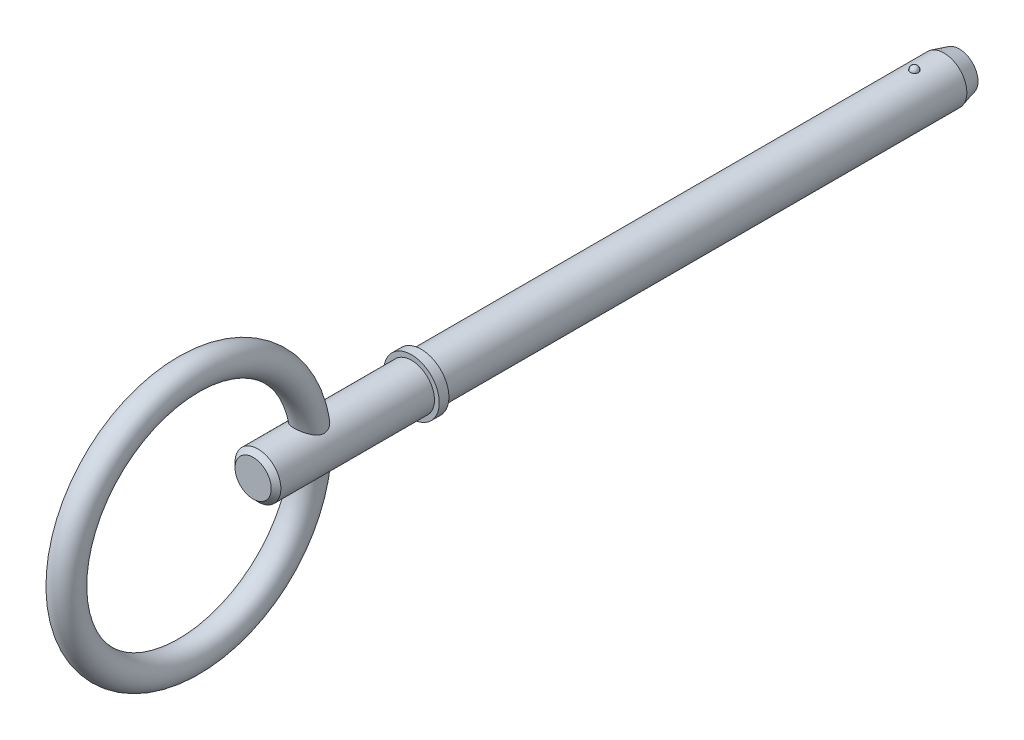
ISO-10303-21;
HEADER;
FILE_DESCRIPTION(('STEP AP214'),'2;1');
FILE_NAME('part.step','',(''),(''),'','','');
FILE_SCHEMA(('AUTOMOTIVE_DESIGN { 1 0 10303 214 1 1 1 1 }'));
ENDSEC;
DATA;
#1=APPLICATION_CONTEXT('core data for automotive mechanical design processes');
#2=APPLICATION_PROTOCOL_DEFINITION('international standard','automotive_design',2000,#1);
#3=PRODUCT_CONTEXT('',#1,'mechanical');
#4=PRODUCT('Part','Part','',(#3));
#5=PRODUCT_RELATED_PRODUCT_CATEGORY('part','',(#4));
#6=PRODUCT_DEFINITION_FORMATION('','',#4);
#7=PRODUCT_DEFINITION_CONTEXT('part definition',#1,'design');
#8=PRODUCT_DEFINITION('design','',#6,#7);
#9=PRODUCT_DEFINITION_SHAPE('','',#8);
#10=(LENGTH_UNIT() NAMED_UNIT(*) SI_UNIT(.MILLI.,.METRE.));
#11=(NAMED_UNIT(*) PLANE_ANGLE_UNIT() SI_UNIT($,.RADIAN.));
#12=(NAMED_UNIT(*) SI_UNIT($,.STERADIAN.) SOLID_ANGLE_UNIT());
#13=UNCERTAINTY_MEASURE_WITH_UNIT(LENGTH_MEASURE(1.E-05),#10,'distance_accuracy_value','');
#14=(GEOMETRIC_REPRESENTATION_CONTEXT(3) GLOBAL_UNCERTAINTY_ASSIGNED_CONTEXT((#13)) GLOBAL_UNIT_ASSIGNED_CONTEXT((#10,
#11,#12)) REPRESENTATION_CONTEXT('',''));
#15=CARTESIAN_POINT('',(0.,0.,0.));
#16=DIRECTION('',(0.,0.,1.));
#17=DIRECTION('',(1.,0.,0.));
#18=AXIS2_PLACEMENT_3D('',#15,#16,#17);
#19=CARTESIAN_POINT('',(0.,0.,50.8));
#20=DIRECTION('',(0.,0.,-1.));
#21=DIRECTION('',(-1.,0.,0.));
#22=AXIS2_PLACEMENT_3D('',#19,#20,#21);
#23=CYLINDRICAL_SURFACE('',#22,2.38);
#24=CARTESIAN_POINT('',(0.418361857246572,2.34294117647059,-0.419999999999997));
#25=CARTESIAN_POINT('',(0.418361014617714,2.34294160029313,-0.396453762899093));
#26=CARTESIAN_POINT('',(0.416399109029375,2.34329426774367,-0.372895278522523));
#27=CARTESIAN_POINT('',(0.408599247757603,2.34466666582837,-0.32643458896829));
#28=CARTESIAN_POINT('',(0.402757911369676,2.34568697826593,-0.303532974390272));
#29=CARTESIAN_POINT('',(0.387358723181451,2.3482789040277,-0.259059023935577));
#30=CARTESIAN_POINT('',(0.377802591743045,2.34985026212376,-0.237486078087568));
#31=CARTESIAN_POINT('',(0.355233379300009,2.35336760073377,-0.196270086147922));
#32=CARTESIAN_POINT('',(0.34222083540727,2.3553135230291,-0.176626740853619));
#33=CARTESIAN_POINT('',(0.313060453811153,2.35936636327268,-0.139777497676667));
#34=CARTESIAN_POINT('',(0.296906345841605,2.36147359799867,-0.122576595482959));
#35=CARTESIAN_POINT('',(0.261921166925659,2.3656092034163,-0.0911421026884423));
#36=CARTESIAN_POINT('',(0.243090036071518,2.36763757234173,-0.0769085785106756));
#37=CARTESIAN_POINT('',(0.203297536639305,2.37138533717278,-0.0518262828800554));
#38=CARTESIAN_POINT('',(0.182338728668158,2.37310509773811,-0.0409735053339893));
#39=CARTESIAN_POINT('',(0.138864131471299,2.37604521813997,-0.0229395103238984));
#40=CARTESIAN_POINT('',(0.116348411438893,2.37726560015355,-0.0157581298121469));
#41=CARTESIAN_POINT('',(0.0705754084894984,2.37906276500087,-0.00531205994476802));
#42=CARTESIAN_POINT('',(0.0473247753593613,2.37964420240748,-0.00201903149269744));
#43=CARTESIAN_POINT('',(0.000593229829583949,2.38011460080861,0.000651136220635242));
#44=CARTESIAN_POINT('',(-0.0228876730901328,2.38000359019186,2.84360175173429E-05));
#45=CARTESIAN_POINT('',(-0.0692686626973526,2.37910422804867,-0.00509943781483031));
#46=CARTESIAN_POINT('',(-0.0921713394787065,2.37831983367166,-0.00958192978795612));
#47=CARTESIAN_POINT('',(-0.136890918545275,2.37616546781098,-0.022272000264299));
#48=CARTESIAN_POINT('',(-0.158707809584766,2.37479549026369,-0.0304796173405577));
#49=CARTESIAN_POINT('',(-0.200704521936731,2.37161607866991,-0.0504168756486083));
#50=CARTESIAN_POINT('',(-0.220879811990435,2.36980547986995,-0.0621558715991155));
#51=CARTESIAN_POINT('',(-0.258974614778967,2.36594575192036,-0.0888218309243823));
#52=CARTESIAN_POINT('',(-0.276894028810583,2.36389661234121,-0.103748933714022));
#53=CARTESIAN_POINT('',(-0.310124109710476,2.35976825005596,-0.136509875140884));
#54=CARTESIAN_POINT('',(-0.325413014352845,2.35768891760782,-0.154365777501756));
#55=CARTESIAN_POINT('',(-0.352793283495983,2.35374782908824,-0.192402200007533));
#56=CARTESIAN_POINT('',(-0.364884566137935,2.35188607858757,-0.212582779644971));
#57=CARTESIAN_POINT('',(-0.385587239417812,2.34858114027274,-0.254794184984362));
#58=CARTESIAN_POINT('',(-0.394183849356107,2.34713973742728,-0.276832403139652));
#59=CARTESIAN_POINT('',(-0.407590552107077,2.3448489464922,-0.322061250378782));
#60=CARTESIAN_POINT('',(-0.412400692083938,2.34399955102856,-0.34525186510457));
#61=CARTESIAN_POINT('',(-0.418098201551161,2.34299005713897,-0.392078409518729));
#62=CARTESIAN_POINT('',(-0.41899328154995,2.34282860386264,-0.415713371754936));
#63=CARTESIAN_POINT('',(-0.416857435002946,2.34320955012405,-0.462799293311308));
#64=CARTESIAN_POINT('',(-0.413826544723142,2.34375194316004,-0.486250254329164));
#65=CARTESIAN_POINT('',(-0.403929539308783,2.34547773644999,-0.532261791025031));
#66=CARTESIAN_POINT('',(-0.397069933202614,2.34666004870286,-0.554823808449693));
#67=CARTESIAN_POINT('',(-0.379705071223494,2.34953208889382,-0.59846383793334));
#68=CARTESIAN_POINT('',(-0.369199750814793,2.35122182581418,-0.61954182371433));
#69=CARTESIAN_POINT('',(-0.344797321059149,2.35492396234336,-0.659671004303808));
#70=CARTESIAN_POINT('',(-0.33089223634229,2.35693711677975,-0.678717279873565));
#71=CARTESIAN_POINT('',(-0.300080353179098,2.36105754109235,-0.714192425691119));
#72=CARTESIAN_POINT('',(-0.283173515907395,2.36316481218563,-0.730621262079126));
#73=CARTESIAN_POINT('',(-0.246801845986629,2.36723962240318,-0.760416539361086));
#74=CARTESIAN_POINT('',(-0.227334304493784,2.36920701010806,-0.773779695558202));
#75=CARTESIAN_POINT('',(-0.186398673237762,2.37277833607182,-0.797042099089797));
#76=CARTESIAN_POINT('',(-0.164930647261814,2.37438228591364,-0.806941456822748));
#77=CARTESIAN_POINT('',(-0.120727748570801,2.37703848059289,-0.82294821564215));
#78=CARTESIAN_POINT('',(-0.0980005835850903,2.37809374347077,-0.829076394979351));
#79=CARTESIAN_POINT('',(-0.0518218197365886,2.37954782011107,-0.837451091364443));
#80=CARTESIAN_POINT('',(-0.0283702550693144,2.37994666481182,-0.839697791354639));
#81=CARTESIAN_POINT('',(0.0184023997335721,2.38004290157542,-0.840243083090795));
#82=CARTESIAN_POINT('',(0.0417231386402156,2.37974556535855,-0.838571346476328));
#83=CARTESIAN_POINT('',(0.0877471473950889,2.37849333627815,-0.831389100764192));
#84=CARTESIAN_POINT('',(0.110450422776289,2.37753844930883,-0.825878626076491));
#85=CARTESIAN_POINT('',(0.154584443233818,2.37507730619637,-0.811179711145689));
#86=CARTESIAN_POINT('',(0.17601599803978,2.37357140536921,-0.801993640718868));
#87=CARTESIAN_POINT('',(0.217028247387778,2.37017355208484,-0.780200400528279));
#88=CARTESIAN_POINT('',(0.236608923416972,2.36828159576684,-0.767593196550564));
#89=CARTESIAN_POINT('',(0.27351405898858,2.36430486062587,-0.739207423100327));
#90=CARTESIAN_POINT('',(0.290821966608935,2.36221883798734,-0.723407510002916));
#91=CARTESIAN_POINT('',(0.322554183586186,2.3580957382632,-0.68912612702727));
#92=CARTESIAN_POINT('',(0.336977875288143,2.35605867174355,-0.670644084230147));
#93=CARTESIAN_POINT('',(0.362636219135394,2.35224677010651,-0.63138169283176));
#94=CARTESIAN_POINT('',(0.373848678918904,2.35047379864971,-0.610586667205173));
#95=CARTESIAN_POINT('',(0.392641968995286,2.34740786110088,-0.567397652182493));
#96=CARTESIAN_POINT('',(0.400225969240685,2.34611447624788,-0.545005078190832));
#97=CARTESIAN_POINT('',(0.410033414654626,2.34441668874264,-0.505456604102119));
#98=CARTESIAN_POINT('',(0.413152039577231,2.34386644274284,-0.488523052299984));
#99=CARTESIAN_POINT('',(0.417316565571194,2.34312853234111,-0.454395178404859));
#100=CARTESIAN_POINT('',(0.418362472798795,2.34294086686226,-0.437200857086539));
#101=CARTESIAN_POINT('',(0.418361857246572,2.34294117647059,-0.419999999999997));
#102=B_SPLINE_CURVE_WITH_KNOTS('',3,(#24,#25,#26,#27,#28,#29,#30,#31,#32,#33,#34,#35,#36,#37,
#38,#39,#40,#41,#42,#43,#44,#45,#46,#47,#48,#49,#50,#51,#52,#53,#54,#55,#56,#57,#58,#59,#60,#61,
#62,#63,#64,#65,#66,#67,#68,#69,#70,#71,#72,#73,#74,#75,#76,#77,#78,#79,#80,#81,#82,#83,#84,#85,
#86,#87,#88,#89,#90,#91,#92,#93,#94,#95,#96,#97,#98,#99,#100,#101),.UNSPECIFIED.,.T.,.F.,(4,2,2,
2,2,2,2,2,2,2,2,2,2,2,2,2,2,2,2,2,2,2,2,2,2,2,2,2,2,2,2,2,2,2,2,2,2,2,4),(0.,0.0705763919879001,
0.141214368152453,0.211819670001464,0.282414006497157,0.353150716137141,0.423889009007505,
0.494543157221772,0.565194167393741,0.635327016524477,0.705456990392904,0.77517764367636,
0.844899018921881,0.914806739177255,0.98471751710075,1.05518143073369,1.1256471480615,
1.19640787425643,1.26716771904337,1.33778814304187,1.40840791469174,1.47890799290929,
1.54940931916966,1.62007764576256,1.69074688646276,1.76149149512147,1.83223384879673,
1.90258285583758,1.97292854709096,2.04274328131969,2.11255738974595,2.18232655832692,
2.25209642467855,2.32234913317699,2.39261687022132,2.4633591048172,2.5340394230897,
2.58559662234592,2.63715366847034),.UNSPECIFIED.);
#103=CARTESIAN_POINT('',(0.418361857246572,2.34294117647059,-0.419999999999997));
#104=VERTEX_POINT('',#103);
#105=EDGE_CURVE('E103',#104,#104,#102,.T.);
#106=ORIENTED_EDGE('',*,*,#105,.T.);
#107=EDGE_LOOP('',(#106));
#108=FACE_BOUND('',#107,.T.);
#109=CARTESIAN_POINT('',(0.,0.,-3.49399999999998));
#110=DIRECTION('',(0.,0.,-1.));
#111=DIRECTION('',(-1.,0.,0.));
#112=AXIS2_PLACEMENT_3D('',#109,#110,#111);
#113=CIRCLE('',#112,2.38);
#114=CARTESIAN_POINT('',(-2.38,0.,-3.49399999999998));
#115=VERTEX_POINT('',#114);
#116=EDGE_CURVE('E110',#115,#115,#113,.F.);
#117=ORIENTED_EDGE('',*,*,#116,.T.);
#118=EDGE_LOOP('',(#117));
#119=FACE_BOUND('',#118,.T.);
#120=CARTESIAN_POINT('',(0.,0.,50.8));
#121=DIRECTION('',(0.,0.,1.));
#122=DIRECTION('',(1.,0.,0.));
#123=AXIS2_PLACEMENT_3D('',#120,#121,#122);
#124=CIRCLE('',#123,2.38);
#125=CARTESIAN_POINT('',(2.38,0.,50.8));
#126=VERTEX_POINT('',#125);
#127=EDGE_CURVE('E108',#126,#126,#124,.T.);
#128=ORIENTED_EDGE('',*,*,#127,.F.);
#129=EDGE_LOOP('',(#128));
#130=FACE_BOUND('',#129,.T.);
#131=ADVANCED_FACE('F39',(#108,#119,#130),#23,.T.);
#132=CARTESIAN_POINT('',(0.,0.,-5.08));
#133=DIRECTION('',(0.,0.,-1.));
#134=DIRECTION('',(-1.,0.,0.));
#135=AXIS2_PLACEMENT_3D('',#132,#133,#134);
#136=PLANE('',#135);
#137=CARTESIAN_POINT('',(0.,0.,-5.08));
#138=DIRECTION('',(0.,0.,-1.));
#139=DIRECTION('',(-1.,0.,0.));
#140=AXIS2_PLACEMENT_3D('',#137,#138,#139);
#141=CIRCLE('',#140,1.95503258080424);
#142=CARTESIAN_POINT('',(-1.95503258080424,0.,-5.08));
#143=VERTEX_POINT('',#142);
#144=EDGE_CURVE('E143',#143,#143,#141,.T.);
#145=ORIENTED_EDGE('',*,*,#144,.T.);
#146=EDGE_LOOP('',(#145));
#147=FACE_BOUND('',#146,.T.);
#148=ADVANCED_FACE('F89',(#147),#136,.T.);
#149=CARTESIAN_POINT('',(0.,0.,-5.08));
#150=DIRECTION('',(0.,0.,1.));
#151=DIRECTION('',(1.,0.,0.));
#152=AXIS2_PLACEMENT_3D('',#149,#150,#151);
#153=CONICAL_SURFACE('',#152,1.95503258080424,0.261799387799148);
#154=ORIENTED_EDGE('',*,*,#116,.F.);
#155=EDGE_LOOP('',(#154));
#156=FACE_BOUND('',#155,.T.);
#157=ORIENTED_EDGE('',*,*,#144,.F.);
#158=EDGE_LOOP('',(#157));
#159=FACE_BOUND('',#158,.T.);
#160=ADVANCED_FACE('F95',(#156,#159),#153,.T.);
#161=CARTESIAN_POINT('',(0.,2.38,-0.419999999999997));
#162=DIRECTION('',(0.,1.,0.));
#163=DIRECTION('',(0.,0.,1.));
#164=AXIS2_PLACEMENT_3D('',#161,#162,#163);
#165=SPHERICAL_SURFACE('',#164,0.419999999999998);
#166=ORIENTED_EDGE('',*,*,#105,.F.);
#167=EDGE_LOOP('',(#166));
#168=FACE_BOUND('',#167,.T.);
#169=ADVANCED_FACE('F113',(#168),#165,.T.);
#170=CARTESIAN_POINT('',(0.,0.,50.8));
#171=DIRECTION('',(0.,0.,-1.));
#172=DIRECTION('',(-1.,0.,0.));
#173=AXIS2_PLACEMENT_3D('',#170,#171,#172);
#174=PLANE('',#173);
#175=ORIENTED_EDGE('',*,*,#127,.T.);
#176=EDGE_LOOP('',(#175));
#177=FACE_BOUND('',#176,.T.);
#178=CARTESIAN_POINT('',(0.,0.,50.8));
#179=DIRECTION('',(0.,0.,-1.));
#180=DIRECTION('',(-1.,0.,0.));
#181=AXIS2_PLACEMENT_3D('',#178,#179,#180);
#182=CIRCLE('',#181,2.88);
#183=CARTESIAN_POINT('',(-2.88,0.,50.8));
#184=VERTEX_POINT('',#183);
#185=EDGE_CURVE('E109',#184,#184,#182,.T.);
#186=ORIENTED_EDGE('',*,*,#185,.T.);
#187=EDGE_LOOP('',(#186));
#188=FACE_BOUND('',#187,.T.);
#189=ADVANCED_FACE('F117',(#177,#188),#174,.T.);
#190=CARTESIAN_POINT('',(0.,0.,33.7287874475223));
#191=DIRECTION('',(0.,0.,-1.));
#192=DIRECTION('',(-1.,0.,0.));
#193=AXIS2_PLACEMENT_3D('',#190,#191,#192);
#194=CYLINDRICAL_SURFACE('',#193,2.88);
#195=CARTESIAN_POINT('',(0.,0.,51.8));
#196=DIRECTION('',(0.,0.,-1.));
#197=DIRECTION('',(-1.,0.,0.));
#198=AXIS2_PLACEMENT_3D('',#195,#196,#197);
#199=CIRCLE('',#198,2.88);
#200=CARTESIAN_POINT('',(-2.88,0.,51.8));
#201=VERTEX_POINT('',#200);
#202=EDGE_CURVE('E134',#201,#201,#199,.T.);
#203=ORIENTED_EDGE('',*,*,#202,.T.);
#204=EDGE_LOOP('',(#203));
#205=FACE_BOUND('',#204,.T.);
#206=ORIENTED_EDGE('',*,*,#185,.F.);
#207=EDGE_LOOP('',(#206));
#208=FACE_BOUND('',#207,.T.);
#209=ADVANCED_FACE('F121',(#205,#208),#194,.T.);
#210=CARTESIAN_POINT('',(0.,2.88,51.8));
#211=DIRECTION('',(0.,0.,1.));
#212=DIRECTION('',(1.,0.,0.));
#213=AXIS2_PLACEMENT_3D('',#210,#211,#212);
#214=PLANE('',#213);
#215=CARTESIAN_POINT('',(0.,0.,51.8));
#216=DIRECTION('',(0.,0.,1.));
#217=DIRECTION('',(1.,0.,0.));
#218=AXIS2_PLACEMENT_3D('',#215,#216,#217);
#219=CIRCLE('',#218,2.38);
#220=CARTESIAN_POINT('',(2.38,0.,51.8));
#221=VERTEX_POINT('',#220);
#222=EDGE_CURVE('E112',#221,#221,#219,.T.);
#223=ORIENTED_EDGE('',*,*,#222,.F.);
#224=EDGE_LOOP('',(#223));
#225=FACE_BOUND('',#224,.T.);
#226=ORIENTED_EDGE('',*,*,#202,.F.);
#227=EDGE_LOOP('',(#226));
#228=FACE_BOUND('',#227,.T.);
#229=ADVANCED_FACE('F86',(#225,#228),#214,.T.);
#230=CARTESIAN_POINT('',(0.,0.,68.25));
#231=DIRECTION('',(0.,0.,-1.));
#232=DIRECTION('',(-1.,0.,0.));
#233=AXIS2_PLACEMENT_3D('',#230,#231,#232);
#234=CYLINDRICAL_SURFACE('',#233,2.38);
#235=CARTESIAN_POINT('',(-0.903407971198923,-2.20187511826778,61.228101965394));
#236=CARTESIAN_POINT('',(-0.839710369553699,-2.22800560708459,61.1836275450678));
#237=CARTESIAN_POINT('',(-0.771955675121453,-2.25255828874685,61.1439200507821));
#238=CARTESIAN_POINT('',(-0.629623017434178,-2.29641711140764,61.0749006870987));
#239=CARTESIAN_POINT('',(-0.555034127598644,-2.31571464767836,61.0456058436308));
#240=CARTESIAN_POINT('',(-0.400673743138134,-2.34735542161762,60.9982943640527));
#241=CARTESIAN_POINT('',(-0.320887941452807,-2.35967847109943,60.9803104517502));
#242=CARTESIAN_POINT('',(-0.158738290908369,-2.37609587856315,60.9564617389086));
#243=CARTESIAN_POINT('',(-0.076376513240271,-2.38019668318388,60.9505874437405));
#244=CARTESIAN_POINT('',(0.0836658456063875,-2.3797998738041,60.9511603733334));
#245=CARTESIAN_POINT('',(0.16135114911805,-2.37576936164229,60.9569382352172));
#246=CARTESIAN_POINT('',(0.314409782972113,-2.36039486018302,60.9792676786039));
#247=CARTESIAN_POINT('',(0.389782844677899,-2.34905002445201,60.9958205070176));
#248=CARTESIAN_POINT('',(0.535937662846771,-2.32006569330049,61.0390515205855));
#249=CARTESIAN_POINT('',(0.606735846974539,-2.30245039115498,61.0656908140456));
#250=CARTESIAN_POINT('',(0.742521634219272,-2.26231731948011,61.1283720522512));
#251=CARTESIAN_POINT('',(0.807508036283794,-2.23979853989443,61.1644159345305));
#252=CARTESIAN_POINT('',(0.935326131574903,-2.18966592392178,61.2483563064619));
#253=CARTESIAN_POINT('',(0.997591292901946,-2.16179128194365,61.2969595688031));
#254=CARTESIAN_POINT('',(1.11292144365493,-2.10474548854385,61.403560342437));
#255=CARTESIAN_POINT('',(1.16597568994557,-2.07557287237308,61.4615686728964));
#256=CARTESIAN_POINT('',(1.26477130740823,-2.01699124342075,61.5902977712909));
#257=CARTESIAN_POINT('',(1.30983402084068,-1.98768494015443,61.6615920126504));
#258=CARTESIAN_POINT('',(1.38660631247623,-1.93491744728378,61.8129637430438));
#259=CARTESIAN_POINT('',(1.41834090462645,-1.91144534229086,61.8930244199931));
#260=CARTESIAN_POINT('',(1.46422131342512,-1.87648847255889,62.0506940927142));
#261=CARTESIAN_POINT('',(1.47990731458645,-1.86397592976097,62.1276190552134));
#262=CARTESIAN_POINT('',(1.49871691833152,-1.84889326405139,62.2838974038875));
#263=CARTESIAN_POINT('',(1.50185388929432,-1.84631256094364,62.3632481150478));
#264=CARTESIAN_POINT('',(1.4964844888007,-1.85065563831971,62.5088470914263));
#265=CARTESIAN_POINT('',(1.48970686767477,-1.85616871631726,62.5752204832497));
#266=CARTESIAN_POINT('',(1.46828795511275,-1.87315650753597,62.7059075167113));
#267=CARTESIAN_POINT('',(1.4536391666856,-1.88463690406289,62.7702191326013));
#268=CARTESIAN_POINT('',(1.40943250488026,-1.91806137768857,62.9230643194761));
#269=CARTESIAN_POINT('',(1.37616344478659,-1.94238425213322,63.0099991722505));
#270=CARTESIAN_POINT('',(1.29708737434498,-1.99605834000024,63.1763485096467));
#271=CARTESIAN_POINT('',(1.25125268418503,-2.02542060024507,63.255745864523));
#272=CARTESIAN_POINT('',(1.14695036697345,-2.08629729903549,63.4076285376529));
#273=CARTESIAN_POINT('',(1.08823347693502,-2.11784433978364,63.4799296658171));
#274=CARTESIAN_POINT('',(0.959228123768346,-2.17930599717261,63.6140708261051));
#275=CARTESIAN_POINT('',(0.888958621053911,-2.20922318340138,63.6759276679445));
#276=CARTESIAN_POINT('',(0.753368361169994,-2.25851185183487,63.7749333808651));
#277=CARTESIAN_POINT('',(0.690173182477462,-2.2787729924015,63.8145392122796));
#278=CARTESIAN_POINT('',(0.557409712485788,-2.31482439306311,63.8839846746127));
#279=CARTESIAN_POINT('',(0.487846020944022,-2.33061784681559,63.9138312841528));
#280=CARTESIAN_POINT('',(0.342953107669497,-2.35631858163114,63.9620255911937));
#281=CARTESIAN_POINT('',(0.267574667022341,-2.36616750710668,63.980259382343));
#282=CARTESIAN_POINT('',(0.114199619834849,-2.37849775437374,64.0030468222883));
#283=CARTESIAN_POINT('',(0.0362059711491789,-2.3809871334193,64.0076154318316));
#284=CARTESIAN_POINT('',(-0.107568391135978,-2.37849121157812,64.0030163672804));
#285=CARTESIAN_POINT('',(-0.173440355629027,-2.37456249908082,63.995790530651));
#286=CARTESIAN_POINT('',(-0.302853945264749,-2.36154811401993,63.9716908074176));
#287=CARTESIAN_POINT('',(-0.366395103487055,-2.35246141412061,63.9548149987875));
#288=CARTESIAN_POINT('',(-0.489880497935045,-2.32988758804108,63.9124346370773));
#289=CARTESIAN_POINT('',(-0.549812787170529,-2.31638670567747,63.8869031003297));
#290=CARTESIAN_POINT('',(-0.665021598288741,-2.28597979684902,63.828489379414));
#291=CARTESIAN_POINT('',(-0.720295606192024,-2.26907194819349,63.7956032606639));
#292=CARTESIAN_POINT('',(-0.851132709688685,-2.22413718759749,63.7063110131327));
#293=CARTESIAN_POINT('',(-0.923680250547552,-2.19467168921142,63.6461969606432));
#294=CARTESIAN_POINT('',(-1.0572291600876,-2.13356097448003,63.5150668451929));
#295=CARTESIAN_POINT('',(-1.11820078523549,-2.1019104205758,63.4440235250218));
#296=CARTESIAN_POINT('',(-1.22894457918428,-2.03916543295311,63.2916118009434));
#297=CARTESIAN_POINT('',(-1.27853191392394,-2.0080868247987,63.2101025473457));
#298=CARTESIAN_POINT('',(-1.36422650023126,-1.95088121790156,63.0387530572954));
#299=CARTESIAN_POINT('',(-1.4003623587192,-1.92474376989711,62.9489310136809));
#300=CARTESIAN_POINT('',(-1.44943039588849,-1.88791548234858,62.7877392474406));
#301=CARTESIAN_POINT('',(-1.46600167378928,-1.87495651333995,62.7180059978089));
#302=CARTESIAN_POINT('',(-1.48984634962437,-1.8560704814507,62.5760551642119));
#303=CARTESIAN_POINT('',(-1.49713400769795,-1.85013263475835,62.5038415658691));
#304=CARTESIAN_POINT('',(-1.5014924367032,-1.84660099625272,62.3583634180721));
#305=CARTESIAN_POINT('',(-1.4984943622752,-1.84906342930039,62.2850950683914));
#306=CARTESIAN_POINT('',(-1.48179888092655,-1.8624661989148,62.1405680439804));
#307=CARTESIAN_POINT('',(-1.46809860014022,-1.87340881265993,62.069309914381));
#308=CARTESIAN_POINT('',(-1.43218989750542,-1.90096973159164,61.9372815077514));
#309=CARTESIAN_POINT('',(-1.41085045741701,-1.91699396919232,61.8761429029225));
#310=CARTESIAN_POINT('',(-1.36038958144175,-1.95312601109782,61.7584385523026));
#311=CARTESIAN_POINT('',(-1.33126141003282,-1.97323734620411,61.7018768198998));
#312=CARTESIAN_POINT('',(-1.2617310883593,-2.01850590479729,61.5870500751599));
#313=CARTESIAN_POINT('',(-1.22036168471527,-2.04397945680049,61.5294985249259));
#314=CARTESIAN_POINT('',(-1.12954254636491,-2.09553139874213,61.4216488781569));
#315=CARTESIAN_POINT('',(-1.08010424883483,-2.12160888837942,61.3713407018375));
#316=CARTESIAN_POINT('',(-0.987769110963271,-2.16578285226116,61.2904848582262));
#317=CARTESIAN_POINT('',(-0.946517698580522,-2.18419033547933,61.2582016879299));
#318=CARTESIAN_POINT('',(-0.903407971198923,-2.20187511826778,61.228101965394));
#319=B_SPLINE_CURVE_WITH_KNOTS('',3,(#235,#236,#237,#238,#239,#240,#241,#242,#243,#244,#245,
#246,#247,#248,#249,#250,#251,#252,#253,#254,#255,#256,#257,#258,#259,#260,#261,#262,#263,#264,
#265,#266,#267,#268,#269,#270,#271,#272,#273,#274,#275,#276,#277,#278,#279,#280,#281,#282,#283,
#284,#285,#286,#287,#288,#289,#290,#291,#292,#293,#294,#295,#296,#297,#298,#299,#300,#301,#302,
#303,#304,#305,#306,#307,#308,#309,#310,#311,#312,#313,#314,#315,#316,#317,#318),.UNSPECIFIED.,
.T.,.F.,(4,2,2,2,2,2,2,2,2,2,2,2,2,2,2,2,2,2,2,2,2,2,2,2,2,2,2,2,2,2,2,2,2,2,2,2,2,2,2,2,2,4),
(0.,0.245727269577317,0.491854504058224,0.738690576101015,0.985333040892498,1.21821047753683,
1.45111486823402,1.68313021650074,1.91519340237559,2.16541572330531,2.41592795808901,
2.68235417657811,2.94827811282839,3.18521517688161,3.42189976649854,3.6219115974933,
3.82211427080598,4.1091894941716,4.3969022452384,4.69076958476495,4.98415935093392,
5.21515577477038,5.44598665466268,5.67904815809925,5.91185441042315,6.11003726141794,
6.30825959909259,6.50710565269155,6.70605834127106,7.00062466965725,7.29593791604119,
7.59575158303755,7.89492395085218,8.11262207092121,8.329985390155,8.54880641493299,
8.76768621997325,8.96702101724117,9.1665287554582,9.3916479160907,9.61645071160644,
9.78275580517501),.UNSPECIFIED.);
#320=CARTESIAN_POINT('',(-0.903407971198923,-2.20187511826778,61.228101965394));
#321=VERTEX_POINT('',#320);
#322=EDGE_CURVE('E10',#321,#321,#319,.T.);
#323=ORIENTED_EDGE('',*,*,#322,.F.);
#324=EDGE_LOOP('',(#323));
#325=FACE_BOUND('',#324,.T.);
#326=CARTESIAN_POINT('',(-0.903407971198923,2.20187511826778,61.228101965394));
#327=CARTESIAN_POINT('',(-0.970214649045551,2.17445928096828,61.2747550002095));
#328=CARTESIAN_POINT('',(-1.03268838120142,2.14525344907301,61.3267440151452));
#329=CARTESIAN_POINT('',(-1.1477077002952,2.0859961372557,61.4406478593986));
#330=CARTESIAN_POINT('',(-1.20022114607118,2.05594226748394,61.5025936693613));
#331=CARTESIAN_POINT('',(-1.2941155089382,1.99817720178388,61.6359266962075));
#332=CARTESIAN_POINT('',(-1.33544720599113,1.9704767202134,61.7073536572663));
#333=CARTESIAN_POINT('',(-1.40506760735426,1.92146090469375,61.8582024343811));
#334=CARTESIAN_POINT('',(-1.43339046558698,1.90012890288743,61.9376026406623));
#335=CARTESIAN_POINT('',(-1.47338334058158,1.86925714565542,62.0934496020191));
#336=CARTESIAN_POINT('',(-1.48649837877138,1.85870842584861,62.1693198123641));
#337=CARTESIAN_POINT('',(-1.50071746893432,1.8472518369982,62.32287045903));
#338=CARTESIAN_POINT('',(-1.50182784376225,1.84633889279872,62.4005499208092));
#339=CARTESIAN_POINT('',(-1.49326645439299,1.85325786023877,62.5439859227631));
#340=CARTESIAN_POINT('',(-1.48506604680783,1.85989666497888,62.6099043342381));
#341=CARTESIAN_POINT('',(-1.46099386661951,1.87886395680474,62.7394790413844));
#342=CARTESIAN_POINT('',(-1.44511553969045,1.8911973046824,62.8031333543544));
#343=CARTESIAN_POINT('',(-1.39754250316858,1.92678855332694,62.9561538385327));
#344=CARTESIAN_POINT('',(-1.36192725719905,1.95245999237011,63.0437372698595));
#345=CARTESIAN_POINT('',(-1.27788657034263,2.00847209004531,63.2109907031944));
#346=CARTESIAN_POINT('',(-1.22943137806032,2.0388235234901,63.2906417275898));
#347=CARTESIAN_POINT('',(-1.11958027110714,2.10119412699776,63.4424206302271));
#348=CARTESIAN_POINT('',(-1.05794784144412,2.13323438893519,63.5143690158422));
#349=CARTESIAN_POINT('',(-0.922772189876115,2.1950849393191,63.6470807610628));
#350=CARTESIAN_POINT('',(-0.849252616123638,2.22489948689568,63.7078658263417));
#351=CARTESIAN_POINT('',(-0.71015276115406,2.27246326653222,63.8023110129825));
#352=CARTESIAN_POINT('',(-0.647015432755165,2.29138112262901,63.8389704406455));
#353=CARTESIAN_POINT('',(-0.514878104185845,2.32463484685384,63.9025884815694));
#354=CARTESIAN_POINT('',(-0.445882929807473,2.3389744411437,63.9295549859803));
#355=CARTESIAN_POINT('',(-0.302797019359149,2.36177853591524,63.9721624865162));
#356=CARTESIAN_POINT('',(-0.228666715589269,2.37019011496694,63.9877015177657));
#357=CARTESIAN_POINT('',(-0.0783799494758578,2.37989644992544,64.0056164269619));
#358=CARTESIAN_POINT('',(-0.00222521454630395,2.38119708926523,64.0080031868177));
#359=CARTESIAN_POINT('',(0.138818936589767,2.37685303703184,63.9999981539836));
#360=CARTESIAN_POINT('',(0.2038414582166,2.37212211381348,63.9912876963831));
#361=CARTESIAN_POINT('',(0.331347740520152,2.3576952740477,63.9645309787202));
#362=CARTESIAN_POINT('',(0.393830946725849,2.34799827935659,63.9464826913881));
#363=CARTESIAN_POINT('',(0.516206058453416,2.32419976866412,63.9016833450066));
#364=CARTESIAN_POINT('',(0.57601519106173,2.31000942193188,63.8747562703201));
#365=CARTESIAN_POINT('',(0.690806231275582,2.27831963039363,63.8136110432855));
#366=CARTESIAN_POINT('',(0.74578539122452,2.26081831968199,63.779388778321));
#367=CARTESIAN_POINT('',(0.876071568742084,2.21443701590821,63.6866108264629));
#368=CARTESIAN_POINT('',(0.948236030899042,2.18416686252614,63.624322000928));
#369=CARTESIAN_POINT('',(1.08068664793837,2.12176774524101,63.4888044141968));
#370=CARTESIAN_POINT('',(1.14094076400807,2.08963406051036,63.4155470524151));
#371=CARTESIAN_POINT('',(1.24978363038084,2.02643655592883,63.258659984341));
#372=CARTESIAN_POINT('',(1.29819307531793,1.99539463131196,63.1748968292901));
#373=CARTESIAN_POINT('',(1.38094965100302,1.93904233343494,62.9989962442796));
#374=CARTESIAN_POINT('',(1.41533296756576,1.91371728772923,62.906881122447));
#375=CARTESIAN_POINT('',(1.46011713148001,1.879629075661,62.7439264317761));
#376=CARTESIAN_POINT('',(1.47459501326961,1.86818653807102,62.6747778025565));
#377=CARTESIAN_POINT('',(1.49436605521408,1.8524142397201,62.534403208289));
#378=CARTESIAN_POINT('',(1.49967306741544,1.84807375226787,62.4631805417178));
#379=CARTESIAN_POINT('',(1.50029887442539,1.84756805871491,62.3202291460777));
#380=CARTESIAN_POINT('',(1.49556248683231,1.8514480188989,62.248499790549));
#381=CARTESIAN_POINT('',(1.47581657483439,1.86722196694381,62.1073512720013));
#382=CARTESIAN_POINT('',(1.46080121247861,1.87912050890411,62.0379334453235));
#383=CARTESIAN_POINT('',(1.42246467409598,1.90827733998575,61.9082199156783));
#384=CARTESIAN_POINT('',(1.39980172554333,1.92509995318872,61.8476260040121));
#385=CARTESIAN_POINT('',(1.34679091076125,1.96255086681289,61.7311857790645));
#386=CARTESIAN_POINT('',(1.31644034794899,1.98318050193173,61.6753411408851));
#387=CARTESIAN_POINT('',(1.24396057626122,2.02954647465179,61.5614514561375));
#388=CARTESIAN_POINT('',(1.20077385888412,2.05559269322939,61.5042068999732));
#389=CARTESIAN_POINT('',(1.10616417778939,2.10801594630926,61.3971320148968));
#390=CARTESIAN_POINT('',(1.05473535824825,2.13439320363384,61.3473070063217));
#391=CARTESIAN_POINT('',(0.936202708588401,2.18924478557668,61.2487347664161));
#392=CARTESIAN_POINT('',(0.867904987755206,2.2174445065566,61.2012583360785));
#393=CARTESIAN_POINT('',(0.722917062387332,2.26885521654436,61.1177494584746));
#394=CARTESIAN_POINT('',(0.646227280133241,2.2920664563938,61.0817164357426));
#395=CARTESIAN_POINT('',(0.487515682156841,2.33094430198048,61.022591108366));
#396=CARTESIAN_POINT('',(0.405587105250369,2.34671524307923,60.9993190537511));
#397=CARTESIAN_POINT('',(0.237955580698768,2.36958127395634,60.9658521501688));
#398=CARTESIAN_POINT('',(0.152255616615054,2.37668309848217,60.9556471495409));
#399=CARTESIAN_POINT('',(-0.0122990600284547,2.38126478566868,60.9490505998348));
#400=CARTESIAN_POINT('',(-0.0910885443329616,2.37954037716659,60.9515167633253));
#401=CARTESIAN_POINT('',(-0.247004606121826,2.36843740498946,60.9675699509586));
#402=CARTESIAN_POINT('',(-0.324130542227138,2.35905594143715,60.9811611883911));
#403=CARTESIAN_POINT('',(-0.473048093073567,2.33371594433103,61.0185984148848));
#404=CARTESIAN_POINT('',(-0.544914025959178,2.31788812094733,61.0422409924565));
#405=CARTESIAN_POINT('',(-0.683201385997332,2.28095222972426,61.0990265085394));
#406=CARTESIAN_POINT('',(-0.749631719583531,2.25985303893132,61.1321534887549));
#407=CARTESIAN_POINT('',(-0.843767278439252,2.22565914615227,61.1880726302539));
#408=CARTESIAN_POINT('',(-0.874007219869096,2.21394047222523,61.2075705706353));
#409=CARTESIAN_POINT('',(-0.903407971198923,2.20187511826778,61.228101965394));
#410=B_SPLINE_CURVE_WITH_KNOTS('',3,(#326,#327,#328,#329,#330,#331,#332,#333,#334,#335,#336,
#337,#338,#339,#340,#341,#342,#343,#344,#345,#346,#347,#348,#349,#350,#351,#352,#353,#354,#355,
#356,#357,#358,#359,#360,#361,#362,#363,#364,#365,#366,#367,#368,#369,#370,#371,#372,#373,#374,
#375,#376,#377,#378,#379,#380,#381,#382,#383,#384,#385,#386,#387,#388,#389,#390,#391,#392,#393,
#394,#395,#396,#397,#398,#399,#400,#401,#402,#403,#404,#405,#406,#407,#408,#409),.UNSPECIFIED.,
.T.,.F.,(4,2,2,2,2,2,2,2,2,2,2,2,2,2,2,2,2,2,2,2,2,2,2,2,2,2,2,2,2,2,2,2,2,2,2,2,2,2,2,2,2,4),
(0.,0.257815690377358,0.516449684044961,0.776204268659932,1.03527292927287,1.26692758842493,
1.49846022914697,1.69794041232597,1.89759118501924,2.1899309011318,2.48295401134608,
2.78175997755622,3.07997865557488,3.30539912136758,3.53063565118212,3.75785831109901,
3.98489294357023,4.1812829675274,4.37771564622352,4.57830350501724,4.77900474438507,
5.07746482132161,5.37671714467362,5.68025255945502,5.98299985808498,6.19688795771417,
6.41045270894,6.62519390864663,6.84005717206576,7.03981304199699,7.23963907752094,
7.46764796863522,7.69581957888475,7.9580466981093,8.22026062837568,8.47867938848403,
8.73689726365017,8.97226876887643,9.20772945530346,9.43863631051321,9.66915690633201,
9.78261824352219),.UNSPECIFIED.);
#411=CARTESIAN_POINT('',(-0.903407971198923,2.20187511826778,61.228101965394));
#412=VERTEX_POINT('',#411);
#413=EDGE_CURVE('E51',#412,#412,#410,.T.);
#414=ORIENTED_EDGE('',*,*,#413,.F.);
#415=EDGE_LOOP('',(#414));
#416=FACE_BOUND('',#415,.T.);
#417=CARTESIAN_POINT('',(0.,0.,67.75));
#418=DIRECTION('',(0.,0.,-1.));
#419=DIRECTION('',(-1.,0.,0.));
#420=AXIS2_PLACEMENT_3D('',#417,#418,#419);
#421=CIRCLE('',#420,2.38);
#422=CARTESIAN_POINT('',(-2.38,0.,67.75));
#423=VERTEX_POINT('',#422);
#424=EDGE_CURVE('E65',#423,#423,#421,.T.);
#425=ORIENTED_EDGE('',*,*,#424,.T.);
#426=EDGE_LOOP('',(#425));
#427=FACE_BOUND('',#426,.T.);
#428=ORIENTED_EDGE('',*,*,#222,.T.);
#429=EDGE_LOOP('',(#428));
#430=FACE_BOUND('',#429,.T.);
#431=ADVANCED_FACE('F70',(#325,#416,#427,#430),#234,.T.);
#432=CARTESIAN_POINT('',(0.,0.,68.25));
#433=DIRECTION('',(0.,0.,-1.));
#434=DIRECTION('',(-1.,0.,0.));
#435=AXIS2_PLACEMENT_3D('',#432,#433,#434);
#436=PLANE('',#435);
#437=CARTESIAN_POINT('',(0.,0.,68.25));
#438=DIRECTION('',(0.,0.,-1.));
#439=DIRECTION('',(-1.,0.,0.));
#440=AXIS2_PLACEMENT_3D('',#437,#438,#439);
#441=CIRCLE('',#440,1.88000000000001);
#442=CARTESIAN_POINT('',(-1.88000000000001,0.,68.25));
#443=VERTEX_POINT('',#442);
#444=EDGE_CURVE('E58',#443,#443,#441,.F.);
#445=ORIENTED_EDGE('',*,*,#444,.T.);
#446=EDGE_LOOP('',(#445));
#447=FACE_BOUND('',#446,.T.);
#448=ADVANCED_FACE('F77',(#447),#436,.F.);
#449=CARTESIAN_POINT('',(0.,0.,67.75));
#450=DIRECTION('',(0.,0.,-1.));
#451=DIRECTION('',(-1.,0.,0.));
#452=AXIS2_PLACEMENT_3D('',#449,#450,#451);
#453=CONICAL_SURFACE('',#452,2.38,0.785398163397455);
#454=ORIENTED_EDGE('',*,*,#444,.F.);
#455=EDGE_LOOP('',(#454));
#456=FACE_BOUND('',#455,.T.);
#457=ORIENTED_EDGE('',*,*,#424,.F.);
#458=EDGE_LOOP('',(#457));
#459=FACE_BOUND('',#458,.T.);
#460=ADVANCED_FACE('F41',(#456,#459),#453,.T.);
#461=CARTESIAN_POINT('',(0.,0.,74.95));
#462=DIRECTION('',(1.,0.,0.));
#463=DIRECTION('',(0.,0.,-1.));
#464=AXIS2_PLACEMENT_3D('',#461,#462,#463);
#465=TOROIDAL_SURFACE('',#464,12.7,1.5);
#466=ORIENTED_EDGE('',*,*,#322,.T.);
#467=EDGE_LOOP('',(#466));
#468=FACE_BOUND('',#467,.T.);
#469=ORIENTED_EDGE('',*,*,#413,.T.);
#470=EDGE_LOOP('',(#469));
#471=FACE_BOUND('',#470,.T.);
#472=ADVANCED_FACE('F74',(#468,#471),#465,.T.);
#473=CLOSED_SHELL('',(#131,#148,#160,#169,#189,#209,#229,#431,#448,#460,#472));
#474=MANIFOLD_SOLID_BREP('B2',#473);
#475=ADVANCED_BREP_SHAPE_REPRESENTATION('',(#18,#474),#14);
#476=SHAPE_DEFINITION_REPRESENTATION(#9,#475);
ENDSEC;
END-ISO-10303-21;
